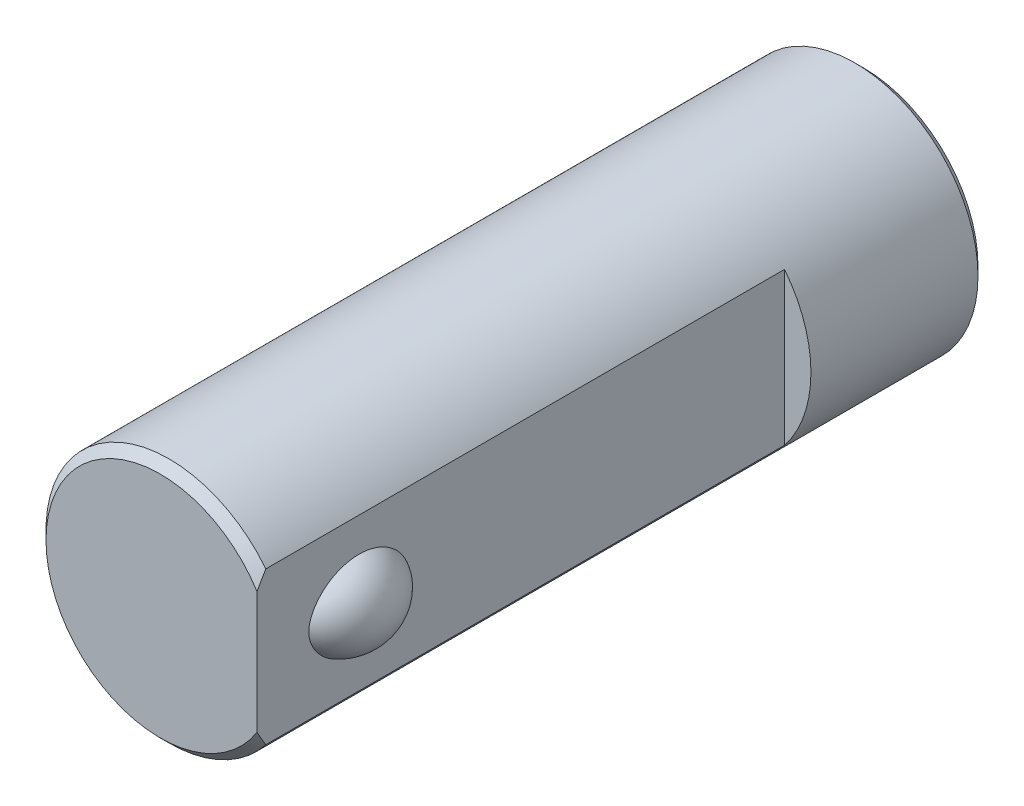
ISO-10303-21;
HEADER;
FILE_DESCRIPTION(('STEP AP214'),'2;1');
FILE_NAME('part.step','',(''),(''),'','','');
FILE_SCHEMA(('AUTOMOTIVE_DESIGN { 1 0 10303 214 1 1 1 1 }'));
ENDSEC;
DATA;
#1=APPLICATION_CONTEXT('core data for automotive mechanical design processes');
#2=APPLICATION_PROTOCOL_DEFINITION('international standard','automotive_design',2000,#1);
#3=PRODUCT_CONTEXT('',#1,'mechanical');
#4=PRODUCT('Part','Part','',(#3));
#5=PRODUCT_RELATED_PRODUCT_CATEGORY('part','',(#4));
#6=PRODUCT_DEFINITION_FORMATION('','',#4);
#7=PRODUCT_DEFINITION_CONTEXT('part definition',#1,'design');
#8=PRODUCT_DEFINITION('design','',#6,#7);
#9=PRODUCT_DEFINITION_SHAPE('','',#8);
#10=(LENGTH_UNIT() NAMED_UNIT(*) SI_UNIT(.MILLI.,.METRE.));
#11=(NAMED_UNIT(*) PLANE_ANGLE_UNIT() SI_UNIT($,.RADIAN.));
#12=(NAMED_UNIT(*) SI_UNIT($,.STERADIAN.) SOLID_ANGLE_UNIT());
#13=UNCERTAINTY_MEASURE_WITH_UNIT(LENGTH_MEASURE(1.E-05),#10,'distance_accuracy_value','');
#14=(GEOMETRIC_REPRESENTATION_CONTEXT(3) GLOBAL_UNCERTAINTY_ASSIGNED_CONTEXT((#13)) GLOBAL_UNIT_ASSIGNED_CONTEXT((#10,
#11,#12)) REPRESENTATION_CONTEXT('',''));
#15=CARTESIAN_POINT('',(0.,0.,0.));
#16=DIRECTION('',(0.,0.,1.));
#17=DIRECTION('',(1.,0.,0.));
#18=AXIS2_PLACEMENT_3D('',#15,#16,#17);
#19=CARTESIAN_POINT('',(0.,0.,0.));
#20=DIRECTION('',(0.,0.,1.));
#21=DIRECTION('',(1.,0.,0.));
#22=AXIS2_PLACEMENT_3D('',#19,#20,#21);
#23=CYLINDRICAL_SURFACE('',#22,7.);
#24=CARTESIAN_POINT('',(0.,0.,0.5));
#25=DIRECTION('',(0.,0.,1.));
#26=DIRECTION('',(1.,0.,0.));
#27=AXIS2_PLACEMENT_3D('',#24,#25,#26);
#28=CIRCLE('',#27,7.);
#29=CARTESIAN_POINT('',(7.,0.,0.5));
#30=VERTEX_POINT('',#29);
#31=EDGE_CURVE('E112',#30,#30,#28,.T.);
#32=ORIENTED_EDGE('',*,*,#31,.T.);
#33=EDGE_LOOP('',(#32));
#34=FACE_BOUND('',#33,.T.);
#35=DIRECTION('',(0.,0.,1.));
#36=VECTOR('',#35,1.);
#37=CARTESIAN_POINT('',(5.5,-4.3301270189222,10.));
#38=LINE('',#37,#36);
#39=CARTESIAN_POINT('',(5.5,-4.3301270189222,10.));
#40=VERTEX_POINT('',#39);
#41=CARTESIAN_POINT('',(5.5,-4.3301270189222,39.5));
#42=VERTEX_POINT('',#41);
#43=EDGE_CURVE('E63',#40,#42,#38,.T.);
#44=ORIENTED_EDGE('',*,*,#43,.T.);
#45=CARTESIAN_POINT('',(0.,0.,39.5));
#46=DIRECTION('',(0.,0.,1.));
#47=DIRECTION('',(1.,0.,0.));
#48=AXIS2_PLACEMENT_3D('',#45,#46,#47);
#49=CIRCLE('',#48,7.);
#50=CARTESIAN_POINT('',(5.5,4.3301270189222,39.5));
#51=VERTEX_POINT('',#50);
#52=EDGE_CURVE('E27',#42,#51,#49,.F.);
#53=ORIENTED_EDGE('',*,*,#52,.T.);
#54=DIRECTION('',(0.,0.,1.));
#55=VECTOR('',#54,1.);
#56=CARTESIAN_POINT('',(5.5,4.3301270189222,10.));
#57=LINE('',#56,#55);
#58=CARTESIAN_POINT('',(5.5,4.3301270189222,10.));
#59=VERTEX_POINT('',#58);
#60=EDGE_CURVE('E61',#59,#51,#57,.T.);
#61=ORIENTED_EDGE('',*,*,#60,.F.);
#62=CARTESIAN_POINT('',(0.,0.,10.));
#63=DIRECTION('',(0.,0.,1.));
#64=DIRECTION('',(1.,0.,0.));
#65=AXIS2_PLACEMENT_3D('',#62,#63,#64);
#66=CIRCLE('',#65,7.);
#67=EDGE_CURVE('E54',#40,#59,#66,.T.);
#68=ORIENTED_EDGE('',*,*,#67,.F.);
#69=EDGE_LOOP('',(#44,#53,#61,#68));
#70=FACE_BOUND('',#69,.T.);
#71=ADVANCED_FACE('F14',(#34,#70),#23,.T.);
#72=CARTESIAN_POINT('',(0.,0.,0.));
#73=DIRECTION('',(0.,0.,1.));
#74=DIRECTION('',(1.,0.,0.));
#75=AXIS2_PLACEMENT_3D('',#72,#73,#74);
#76=PLANE('',#75);
#77=CARTESIAN_POINT('',(0.,0.,0.));
#78=DIRECTION('',(0.,0.,1.));
#79=DIRECTION('',(1.,0.,0.));
#80=AXIS2_PLACEMENT_3D('',#77,#78,#79);
#81=CIRCLE('',#80,6.5);
#82=CARTESIAN_POINT('',(6.5,0.,0.));
#83=VERTEX_POINT('',#82);
#84=EDGE_CURVE('E9',#83,#83,#81,.F.);
#85=ORIENTED_EDGE('',*,*,#84,.T.);
#86=EDGE_LOOP('',(#85));
#87=FACE_BOUND('',#86,.T.);
#88=ADVANCED_FACE('F95',(#87),#76,.F.);
#89=CARTESIAN_POINT('',(0.,0.,40.));
#90=DIRECTION('',(0.,0.,1.));
#91=DIRECTION('',(1.,0.,0.));
#92=AXIS2_PLACEMENT_3D('',#89,#90,#91);
#93=PLANE('',#92);
#94=DIRECTION('',(0.,-1.,0.));
#95=VECTOR('',#94,1.);
#96=CARTESIAN_POINT('',(5.5,4.3301270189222,40.));
#97=LINE('',#96,#95);
#98=CARTESIAN_POINT('',(5.5,3.46410161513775,40.));
#99=VERTEX_POINT('',#98);
#100=CARTESIAN_POINT('',(5.5,-3.46410161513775,40.));
#101=VERTEX_POINT('',#100);
#102=EDGE_CURVE('E58',#99,#101,#97,.T.);
#103=ORIENTED_EDGE('',*,*,#102,.F.);
#104=CARTESIAN_POINT('',(0.,0.,40.));
#105=DIRECTION('',(0.,0.,1.));
#106=DIRECTION('',(1.,0.,0.));
#107=AXIS2_PLACEMENT_3D('',#104,#105,#106);
#108=CIRCLE('',#107,6.5);
#109=EDGE_CURVE('E66',#99,#101,#108,.T.);
#110=ORIENTED_EDGE('',*,*,#109,.T.);
#111=EDGE_LOOP('',(#103,#110));
#112=FACE_BOUND('',#111,.T.);
#113=ADVANCED_FACE('F90',(#112),#93,.T.);
#114=CARTESIAN_POINT('',(5.5,4.3301270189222,10.));
#115=DIRECTION('',(-1.,0.,0.));
#116=DIRECTION('',(0.,-1.,0.));
#117=AXIS2_PLACEMENT_3D('',#114,#115,#116);
#118=PLANE('',#117);
#119=CARTESIAN_POINT('',(5.5,-2.40121497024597,34.2));
#120=CARTESIAN_POINT('',(5.5,-2.40121538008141,34.3718305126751));
#121=CARTESIAN_POINT('',(5.5,-2.38673664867,34.5436510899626));
#122=CARTESIAN_POINT('',(5.5,-2.32920011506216,34.8824214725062));
#123=CARTESIAN_POINT('',(5.5,-2.28614639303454,35.0493719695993));
#124=CARTESIAN_POINT('',(5.5,-2.17252938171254,35.3737271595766));
#125=CARTESIAN_POINT('',(5.5,-2.10195507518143,35.5311280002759));
#126=CARTESIAN_POINT('',(5.5,-1.93507583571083,35.8316912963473));
#127=CARTESIAN_POINT('',(5.5,-1.83876388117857,35.9748498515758));
#128=CARTESIAN_POINT('',(5.5,-1.62400762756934,36.2407675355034));
#129=CARTESIAN_POINT('',(5.5,-1.5058508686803,36.3637564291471));
#130=CARTESIAN_POINT('',(5.5,-1.31368645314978,36.5308249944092));
#131=CARTESIAN_POINT('',(5.5,-1.24711083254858,36.5836314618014));
#132=CARTESIAN_POINT('',(5.5,-1.10930346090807,36.6827523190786));
#133=CARTESIAN_POINT('',(5.5,-1.03807384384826,36.7290696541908));
#134=CARTESIAN_POINT('',(5.5,-0.869107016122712,36.827258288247));
#135=CARTESIAN_POINT('',(5.5,-0.769865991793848,36.8765757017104));
#136=CARTESIAN_POINT('',(5.5,-0.565139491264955,36.9596672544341));
#137=CARTESIAN_POINT('',(5.5,-0.459672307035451,36.9934845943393));
#138=CARTESIAN_POINT('',(5.5,-0.307394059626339,37.0271364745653));
#139=CARTESIAN_POINT('',(5.5,-0.262366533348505,37.0352774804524));
#140=CARTESIAN_POINT('',(5.5,-0.171799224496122,37.0477739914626));
#141=CARTESIAN_POINT('',(5.5,-0.126259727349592,37.0521315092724));
#142=CARTESIAN_POINT('',(5.5,-0.0350108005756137,37.0568428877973));
#143=CARTESIAN_POINT('',(5.5,0.0106984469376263,37.057200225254));
#144=CARTESIAN_POINT('',(5.5,0.101966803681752,37.0539074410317));
#145=CARTESIAN_POINT('',(5.5,0.147525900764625,37.0502570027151));
#146=CARTESIAN_POINT('',(5.5,0.283042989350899,37.0336002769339));
#147=CARTESIAN_POINT('',(5.5,0.372335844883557,37.014911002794));
#148=CARTESIAN_POINT('',(5.5,0.547438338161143,36.9649869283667));
#149=CARTESIAN_POINT('',(5.5,0.633237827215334,36.933718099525));
#150=CARTESIAN_POINT('',(5.5,0.781946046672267,36.8690906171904));
#151=CARTESIAN_POINT('',(5.5,0.845731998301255,36.8377115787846));
#152=CARTESIAN_POINT('',(5.5,0.970375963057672,36.7695755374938));
#153=CARTESIAN_POINT('',(5.5,1.03123269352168,36.7328162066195));
#154=CARTESIAN_POINT('',(5.5,1.20907955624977,36.6153602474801));
#155=CARTESIAN_POINT('',(5.5,1.32139344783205,36.5274644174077));
#156=CARTESIAN_POINT('',(5.5,1.53380190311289,36.3340389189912));
#157=CARTESIAN_POINT('',(5.5,1.63359359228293,36.2281803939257));
#158=CARTESIAN_POINT('',(5.5,1.81655233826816,36.0030273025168));
#159=CARTESIAN_POINT('',(5.5,1.89972336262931,35.8837359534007));
#160=CARTESIAN_POINT('',(5.5,2.0583795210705,35.6169871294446));
#161=CARTESIAN_POINT('',(5.5,2.13117409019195,35.4679218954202));
#162=CARTESIAN_POINT('',(5.5,2.25163764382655,35.1599136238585));
#163=CARTESIAN_POINT('',(5.5,2.29929395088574,35.0009656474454));
#164=CARTESIAN_POINT('',(5.5,2.36945490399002,34.6721142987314));
#165=CARTESIAN_POINT('',(5.5,2.39107990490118,34.5020225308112));
#166=CARTESIAN_POINT('',(5.5,2.40572215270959,34.1606060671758));
#167=CARTESIAN_POINT('',(5.5,2.39873677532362,33.989281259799));
#168=CARTESIAN_POINT('',(5.5,2.35615198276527,33.6487479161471));
#169=CARTESIAN_POINT('',(5.5,2.32031197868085,33.4795693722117));
#170=CARTESIAN_POINT('',(5.5,2.22065066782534,33.1497164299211));
#171=CARTESIAN_POINT('',(5.5,2.15683799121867,32.9890394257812));
#172=CARTESIAN_POINT('',(5.5,2.00317696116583,32.6814925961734));
#173=CARTESIAN_POINT('',(5.5,1.91344143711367,32.5345665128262));
#174=CARTESIAN_POINT('',(5.5,1.7099360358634,32.2581297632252));
#175=CARTESIAN_POINT('',(5.5,1.5961360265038,32.128641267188));
#176=CARTESIAN_POINT('',(5.5,1.35003409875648,31.894614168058));
#177=CARTESIAN_POINT('',(5.5,1.2182250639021,31.7895645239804));
#178=CARTESIAN_POINT('',(5.5,1.00760926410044,31.6522182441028));
#179=CARTESIAN_POINT('',(5.5,0.935275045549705,31.6098162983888));
#180=CARTESIAN_POINT('',(5.5,0.786645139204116,31.5327320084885));
#181=CARTESIAN_POINT('',(5.5,0.710352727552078,31.4980434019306));
#182=CARTESIAN_POINT('',(5.5,0.542249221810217,31.4332120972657));
#183=CARTESIAN_POINT('',(5.5,0.449839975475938,31.4045579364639));
#184=CARTESIAN_POINT('',(5.5,0.308860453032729,31.3730865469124));
#185=CARTESIAN_POINT('',(5.5,0.261543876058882,31.3645185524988));
#186=CARTESIAN_POINT('',(5.5,0.166349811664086,31.3515705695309));
#187=CARTESIAN_POINT('',(5.5,0.118472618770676,31.3471884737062));
#188=CARTESIAN_POINT('',(5.5,0.022234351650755,31.3428423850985));
#189=CARTESIAN_POINT('',(5.5,-0.0261279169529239,31.3429042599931));
#190=CARTESIAN_POINT('',(5.5,-0.122627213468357,31.347499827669));
#191=CARTESIAN_POINT('',(5.5,-0.170764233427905,31.3520336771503));
#192=CARTESIAN_POINT('',(5.5,-0.314555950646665,31.3720252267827));
#193=CARTESIAN_POINT('',(5.5,-0.409370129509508,31.3938812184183));
#194=CARTESIAN_POINT('',(5.5,-0.562948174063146,31.4414824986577));
#195=CARTESIAN_POINT('',(5.5,-0.622994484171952,31.4633695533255));
#196=CARTESIAN_POINT('',(5.5,-0.740982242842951,31.5122727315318));
#197=CARTESIAN_POINT('',(5.5,-0.798923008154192,31.5392905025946));
#198=CARTESIAN_POINT('',(5.5,-0.969319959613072,31.6271162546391));
#199=CARTESIAN_POINT('',(5.5,-1.07833213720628,31.6946905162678));
#200=CARTESIAN_POINT('',(5.5,-1.28896713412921,31.8467743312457));
#201=CARTESIAN_POINT('',(5.5,-1.3902471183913,31.9317519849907));
#202=CARTESIAN_POINT('',(5.5,-1.58013180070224,32.1146917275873));
#203=CARTESIAN_POINT('',(5.5,-1.66874451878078,32.2126455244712));
#204=CARTESIAN_POINT('',(5.5,-1.84978741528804,32.4418059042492));
#205=CARTESIAN_POINT('',(5.5,-1.93892526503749,32.5756295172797));
#206=CARTESIAN_POINT('',(5.5,-2.09491202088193,32.8558069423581));
#207=CARTESIAN_POINT('',(5.5,-2.16173764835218,33.0021736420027));
#208=CARTESIAN_POINT('',(5.5,-2.27758969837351,33.3202461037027));
#209=CARTESIAN_POINT('',(5.5,-2.32384754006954,33.4929676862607));
#210=CARTESIAN_POINT('',(5.5,-2.38565974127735,33.8437964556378));
#211=CARTESIAN_POINT('',(5.5,-2.40121454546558,34.0219035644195));
#212=CARTESIAN_POINT('',(5.5,-2.40121497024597,34.2));
#213=B_SPLINE_CURVE_WITH_KNOTS('',3,(#119,#120,#121,#122,#123,#124,#125,#126,#127,#128,#129,
#130,#131,#132,#133,#134,#135,#136,#137,#138,#139,#140,#141,#142,#143,#144,#145,#146,#147,#148,
#149,#150,#151,#152,#153,#154,#155,#156,#157,#158,#159,#160,#161,#162,#163,#164,#165,#166,#167,
#168,#169,#170,#171,#172,#173,#174,#175,#176,#177,#178,#179,#180,#181,#182,#183,#184,#185,#186,
#187,#188,#189,#190,#191,#192,#193,#194,#195,#196,#197,#198,#199,#200,#201,#202,#203,#204,#205,
#206,#207,#208,#209,#210,#211,#212),.UNSPECIFIED.,.T.,.F.,(4,2,2,2,2,2,2,2,2,2,2,2,2,2,2,2,2,2,
2,2,2,2,2,2,2,2,2,2,2,2,2,2,2,2,2,2,2,2,2,2,2,2,2,2,2,2,4),(0.,0.514868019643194,
1.02966253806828,1.54466335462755,2.0598048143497,2.56859444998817,2.82321356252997,
3.0777167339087,3.40915763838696,3.73966907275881,3.8768116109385,4.01388114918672,
4.15083154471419,4.28779276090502,4.56024855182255,4.83344636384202,5.04642968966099,
5.2595054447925,5.68550385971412,6.12036609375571,6.55512439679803,7.05052943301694,
7.54618406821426,8.05815576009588,8.57017441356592,9.08650703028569,9.60268045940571,
10.116640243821,10.6312474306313,11.1338640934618,11.3850358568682,11.6360029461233,
11.9250523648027,12.0691564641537,12.2131879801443,12.3580579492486,12.502932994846,
12.7933373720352,12.9848599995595,13.1764442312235,13.5596709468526,13.9550204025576,
14.3501184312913,14.8303577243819,15.3110965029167,15.8447472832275,16.3783903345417),.UNSPECIFIED.);
#214=CARTESIAN_POINT('',(5.5,-2.40121497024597,34.2));
#215=VERTEX_POINT('',#214);
#216=EDGE_CURVE('E17',#215,#215,#213,.T.);
#217=ORIENTED_EDGE('',*,*,#216,.T.);
#218=EDGE_LOOP('',(#217));
#219=FACE_BOUND('',#218,.T.);
#220=ORIENTED_EDGE('',*,*,#102,.T.);
#221=CARTESIAN_POINT('',(5.5,-3.46410161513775,40.));
#222=CARTESIAN_POINT('',(5.5,-3.53766668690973,39.9607922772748));
#223=CARTESIAN_POINT('',(5.5,-3.61086033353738,39.9208924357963));
#224=CARTESIAN_POINT('',(5.5,-3.75652343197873,39.8398347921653));
#225=CARTESIAN_POINT('',(5.5,-3.82899306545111,39.7986773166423));
#226=CARTESIAN_POINT('',(5.5,-3.97326249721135,39.7152116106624));
#227=CARTESIAN_POINT('',(5.5,-4.04506231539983,39.6729034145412));
#228=CARTESIAN_POINT('',(5.5,-4.18804957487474,39.5872228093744));
#229=CARTESIAN_POINT('',(5.5,-4.25923685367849,39.5438501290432));
#230=CARTESIAN_POINT('',(5.5,-4.3301270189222,39.5));
#231=B_SPLINE_CURVE_WITH_KNOTS('',3,(#221,#222,#223,#224,#225,#226,#227,#228,#229,#230),
.UNSPECIFIED.,.F.,.F.,(4,2,2,2,4),(0.,0.25007622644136,0.500088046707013,0.750092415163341,
1.00016117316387),.UNSPECIFIED.);
#232=EDGE_CURVE('E41',#101,#42,#231,.T.);
#233=ORIENTED_EDGE('',*,*,#232,.T.);
#234=ORIENTED_EDGE('',*,*,#43,.F.);
#235=DIRECTION('',(0.,-1.,0.));
#236=VECTOR('',#235,1.);
#237=CARTESIAN_POINT('',(5.5,4.3301270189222,10.));
#238=LINE('',#237,#236);
#239=EDGE_CURVE('E57',#59,#40,#238,.T.);
#240=ORIENTED_EDGE('',*,*,#239,.F.);
#241=ORIENTED_EDGE('',*,*,#60,.T.);
#242=CARTESIAN_POINT('',(5.5,4.3301270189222,39.5));
#243=CARTESIAN_POINT('',(5.5,4.25923685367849,39.5438501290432));
#244=CARTESIAN_POINT('',(5.5,4.18804957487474,39.5872228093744));
#245=CARTESIAN_POINT('',(5.5,4.04506231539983,39.6729034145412));
#246=CARTESIAN_POINT('',(5.5,3.97326249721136,39.7152116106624));
#247=CARTESIAN_POINT('',(5.5,3.82899306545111,39.7986773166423));
#248=CARTESIAN_POINT('',(5.5,3.75652343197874,39.8398347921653));
#249=CARTESIAN_POINT('',(5.5,3.61086033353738,39.9208924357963));
#250=CARTESIAN_POINT('',(5.5,3.53766668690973,39.9607922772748));
#251=CARTESIAN_POINT('',(5.5,3.46410161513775,40.));
#252=B_SPLINE_CURVE_WITH_KNOTS('',3,(#242,#243,#244,#245,#246,#247,#248,#249,#250,#251),
.UNSPECIFIED.,.F.,.F.,(4,2,2,2,4),(0.,0.250068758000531,0.500073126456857,0.750084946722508,
1.00016117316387),.UNSPECIFIED.);
#253=EDGE_CURVE('E71',#51,#99,#252,.T.);
#254=ORIENTED_EDGE('',*,*,#253,.T.);
#255=EDGE_LOOP('',(#220,#233,#234,#240,#241,#254));
#256=FACE_BOUND('',#255,.T.);
#257=ADVANCED_FACE('F60',(#219,#256),#118,.F.);
#258=CARTESIAN_POINT('',(0.,0.,10.));
#259=DIRECTION('',(0.,0.,1.));
#260=DIRECTION('',(1.,0.,0.));
#261=AXIS2_PLACEMENT_3D('',#258,#259,#260);
#262=PLANE('',#261);
#263=ORIENTED_EDGE('',*,*,#67,.T.);
#264=ORIENTED_EDGE('',*,*,#239,.T.);
#265=EDGE_LOOP('',(#263,#264));
#266=FACE_BOUND('',#265,.T.);
#267=ADVANCED_FACE('F56',(#266),#262,.T.);
#268=CARTESIAN_POINT('',(0.,0.,40.));
#269=DIRECTION('',(0.,0.,-1.));
#270=DIRECTION('',(-1.,0.,0.));
#271=AXIS2_PLACEMENT_3D('',#268,#269,#270);
#272=CONICAL_SURFACE('',#271,6.5,0.785398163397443);
#273=ORIENTED_EDGE('',*,*,#253,.F.);
#274=ORIENTED_EDGE('',*,*,#52,.F.);
#275=ORIENTED_EDGE('',*,*,#232,.F.);
#276=ORIENTED_EDGE('',*,*,#109,.F.);
#277=EDGE_LOOP('',(#273,#274,#275,#276));
#278=FACE_BOUND('',#277,.T.);
#279=ADVANCED_FACE('F83',(#278),#272,.T.);
#280=CARTESIAN_POINT('',(0.,0.,0.5));
#281=DIRECTION('',(0.,0.,1.));
#282=DIRECTION('',(1.,0.,0.));
#283=AXIS2_PLACEMENT_3D('',#280,#281,#282);
#284=CONICAL_SURFACE('',#283,7.,0.785398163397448);
#285=ORIENTED_EDGE('',*,*,#84,.F.);
#286=EDGE_LOOP('',(#285));
#287=FACE_BOUND('',#286,.T.);
#288=ORIENTED_EDGE('',*,*,#31,.F.);
#289=EDGE_LOOP('',(#288));
#290=FACE_BOUND('',#289,.T.);
#291=ADVANCED_FACE('F106',(#287,#290),#284,.T.);
#292=CARTESIAN_POINT('',(4.65416666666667,0.,34.2));
#293=DIRECTION('',(0.,0.,1.));
#294=DIRECTION('',(1.,0.,0.));
#295=AXIS2_PLACEMENT_3D('',#292,#293,#294);
#296=DEGENERATE_TOROIDAL_SURFACE('',#295,0.704166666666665,3.25,.F.);
#297=ORIENTED_EDGE('',*,*,#216,.F.);
#298=EDGE_LOOP('',(#297));
#299=FACE_BOUND('',#298,.T.);
#300=ADVANCED_FACE('F109',(#299),#296,.F.);
#301=CLOSED_SHELL('',(#71,#88,#113,#257,#267,#279,#291,#300));
#302=MANIFOLD_SOLID_BREP('B1',#301);
#303=ADVANCED_BREP_SHAPE_REPRESENTATION('',(#18,#302),#14);
#304=SHAPE_DEFINITION_REPRESENTATION(#9,#303);
ENDSEC;
END-ISO-10303-21;
